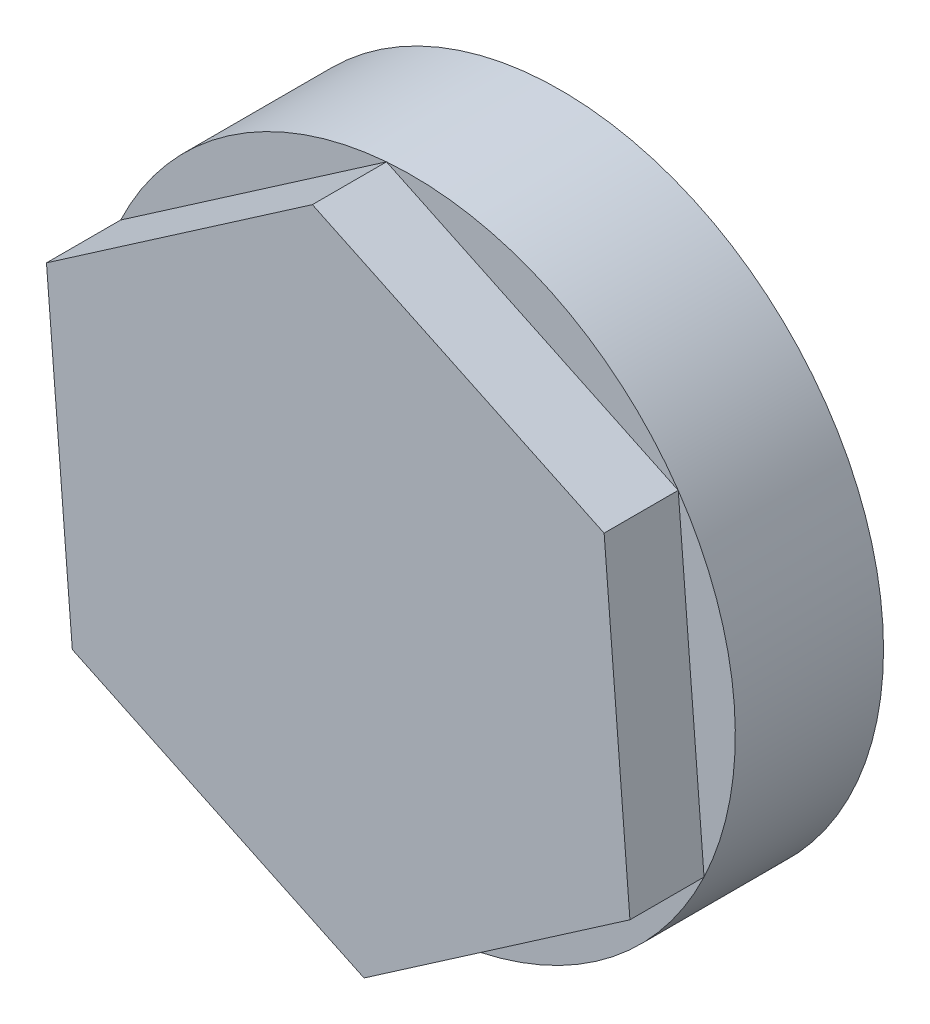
ISO-10303-21;
HEADER;
FILE_DESCRIPTION(('STEP AP214'),'2;1');
FILE_NAME('part.step','',(''),(''),'','','');
FILE_SCHEMA(('AUTOMOTIVE_DESIGN { 1 0 10303 214 1 1 1 1 }'));
ENDSEC;
DATA;
#1=APPLICATION_CONTEXT('core data for automotive mechanical design processes');
#2=APPLICATION_PROTOCOL_DEFINITION('international standard','automotive_design',2000,#1);
#3=PRODUCT_CONTEXT('',#1,'mechanical');
#4=PRODUCT('Part','Part','',(#3));
#5=PRODUCT_RELATED_PRODUCT_CATEGORY('part','',(#4));
#6=PRODUCT_DEFINITION_FORMATION('','',#4);
#7=PRODUCT_DEFINITION_CONTEXT('part definition',#1,'design');
#8=PRODUCT_DEFINITION('design','',#6,#7);
#9=PRODUCT_DEFINITION_SHAPE('','',#8);
#10=(LENGTH_UNIT() NAMED_UNIT(*) SI_UNIT(.MILLI.,.METRE.));
#11=(NAMED_UNIT(*) PLANE_ANGLE_UNIT() SI_UNIT($,.RADIAN.));
#12=(NAMED_UNIT(*) SI_UNIT($,.STERADIAN.) SOLID_ANGLE_UNIT());
#13=UNCERTAINTY_MEASURE_WITH_UNIT(LENGTH_MEASURE(1.E-05),#10,'distance_accuracy_value','');
#14=(GEOMETRIC_REPRESENTATION_CONTEXT(3) GLOBAL_UNCERTAINTY_ASSIGNED_CONTEXT((#13)) GLOBAL_UNIT_ASSIGNED_CONTEXT((#10,
#11,#12)) REPRESENTATION_CONTEXT('',''));
#15=CARTESIAN_POINT('',(0.,0.,0.));
#16=DIRECTION('',(0.,0.,1.));
#17=DIRECTION('',(1.,0.,0.));
#18=AXIS2_PLACEMENT_3D('',#15,#16,#17);
#19=CARTESIAN_POINT('',(39.8386023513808,59.6717164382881,10.));
#20=DIRECTION('',(0.,0.,1.));
#21=DIRECTION('',(1.,0.,0.));
#22=AXIS2_PLACEMENT_3D('',#19,#20,#21);
#23=PLANE('',#22);
#24=DIRECTION('',(0.823257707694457,0.567667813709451,0.));
#25=VECTOR('',#24,1.);
#26=CARTESIAN_POINT('',(41.5816515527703,37.9495804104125,10.));
#27=LINE('',#26,#25);
#28=CARTESIAN_POINT('',(41.5816515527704,37.9495804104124,10.));
#29=VERTEX_POINT('',#28);
#30=CARTESIAN_POINT('',(59.5220485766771,50.3201733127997,10.));
#31=VERTEX_POINT('',#30);
#32=EDGE_CURVE('E56',#29,#31,#27,.T.);
#33=ORIENTED_EDGE('',*,*,#32,.F.);
#34=CARTESIAN_POINT('',(39.8386023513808,59.6717164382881,10.));
#35=DIRECTION('',(0.,0.,1.));
#36=DIRECTION('',(1.,0.,0.));
#37=AXIS2_PLACEMENT_3D('',#34,#35,#36);
#38=CIRCLE('',#37,21.7919575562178);
#39=EDGE_CURVE('E112',#29,#31,#38,.T.);
#40=ORIENTED_EDGE('',*,*,#39,.T.);
#41=EDGE_LOOP('',(#33,#40));
#42=FACE_BOUND('',#41,.T.);
#43=ADVANCED_FACE('F34',(#42),#23,.T.);
#44=DIRECTION('',(0.903243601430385,-0.429128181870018,0.));
#45=VECTOR('',#44,1.);
#46=CARTESIAN_POINT('',(21.8982053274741,47.3011235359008,10.));
#47=LINE('',#46,#45);
#48=CARTESIAN_POINT('',(21.8982053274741,47.3011235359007,10.));
#49=VERTEX_POINT('',#48);
#50=EDGE_CURVE('E109',#49,#29,#47,.T.);
#51=ORIENTED_EDGE('',*,*,#50,.F.);
#52=EDGE_CURVE('E196',#49,#29,#38,.T.);
#53=ORIENTED_EDGE('',*,*,#52,.T.);
#54=EDGE_LOOP('',(#51,#53));
#55=FACE_BOUND('',#54,.T.);
#56=ADVANCED_FACE('F158',(#55),#23,.T.);
#57=DIRECTION('',(0.0799858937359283,-0.996795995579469,0.));
#58=VECTOR('',#57,1.);
#59=CARTESIAN_POINT('',(20.1551561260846,69.0232595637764,10.));
#60=LINE('',#59,#58);
#61=CARTESIAN_POINT('',(20.1551561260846,69.0232595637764,10.));
#62=VERTEX_POINT('',#61);
#63=EDGE_CURVE('E128',#62,#49,#60,.T.);
#64=ORIENTED_EDGE('',*,*,#63,.F.);
#65=EDGE_CURVE('E200',#62,#49,#38,.T.);
#66=ORIENTED_EDGE('',*,*,#65,.T.);
#67=EDGE_LOOP('',(#64,#66));
#68=FACE_BOUND('',#67,.T.);
#69=ADVANCED_FACE('F164',(#68),#23,.T.);
#70=DIRECTION('',(-0.823257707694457,-0.567667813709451,0.));
#71=VECTOR('',#70,1.);
#72=CARTESIAN_POINT('',(38.0955531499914,81.3938524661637,10.));
#73=LINE('',#72,#71);
#74=CARTESIAN_POINT('',(38.0955531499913,81.3938524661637,10.));
#75=VERTEX_POINT('',#74);
#76=EDGE_CURVE('E131',#75,#62,#73,.T.);
#77=ORIENTED_EDGE('',*,*,#76,.F.);
#78=EDGE_CURVE('E42',#75,#62,#38,.T.);
#79=ORIENTED_EDGE('',*,*,#78,.T.);
#80=EDGE_LOOP('',(#77,#79));
#81=FACE_BOUND('',#80,.T.);
#82=ADVANCED_FACE('F175',(#81),#23,.T.);
#83=DIRECTION('',(-0.903243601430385,0.429128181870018,0.));
#84=VECTOR('',#83,1.);
#85=CARTESIAN_POINT('',(57.7789993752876,72.0423093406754,10.));
#86=LINE('',#85,#84);
#87=CARTESIAN_POINT('',(57.7789993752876,72.0423093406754,10.));
#88=VERTEX_POINT('',#87);
#89=EDGE_CURVE('E134',#88,#75,#86,.T.);
#90=ORIENTED_EDGE('',*,*,#89,.F.);
#91=EDGE_CURVE('E12',#88,#75,#38,.T.);
#92=ORIENTED_EDGE('',*,*,#91,.T.);
#93=EDGE_LOOP('',(#90,#92));
#94=FACE_BOUND('',#93,.T.);
#95=ADVANCED_FACE('F168',(#94),#23,.T.);
#96=CARTESIAN_POINT('',(39.8386023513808,59.6717164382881,10.));
#97=DIRECTION('',(0.,0.,-1.));
#98=DIRECTION('',(-1.,0.,0.));
#99=AXIS2_PLACEMENT_3D('',#96,#97,#98);
#100=CYLINDRICAL_SURFACE('',#99,21.7919575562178);
#101=ORIENTED_EDGE('',*,*,#91,.F.);
#102=EDGE_CURVE('E43',#31,#88,#38,.T.);
#103=ORIENTED_EDGE('',*,*,#102,.F.);
#104=ORIENTED_EDGE('',*,*,#39,.F.);
#105=ORIENTED_EDGE('',*,*,#52,.F.);
#106=ORIENTED_EDGE('',*,*,#65,.F.);
#107=ORIENTED_EDGE('',*,*,#78,.F.);
#108=EDGE_LOOP('',(#101,#103,#104,#105,#106,#107));
#109=FACE_BOUND('',#108,.T.);
#110=CARTESIAN_POINT('',(39.8386023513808,59.6717164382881,0.));
#111=DIRECTION('',(0.,0.,1.));
#112=DIRECTION('',(1.,0.,0.));
#113=AXIS2_PLACEMENT_3D('',#110,#111,#112);
#114=CIRCLE('',#113,21.7919575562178);
#115=CARTESIAN_POINT('',(61.6305599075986,59.6717164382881,0.));
#116=VERTEX_POINT('',#115);
#117=EDGE_CURVE('E139',#116,#116,#114,.T.);
#118=ORIENTED_EDGE('',*,*,#117,.T.);
#119=EDGE_LOOP('',(#118));
#120=FACE_BOUND('',#119,.T.);
#121=ADVANCED_FACE('F149',(#109,#120),#100,.T.);
#122=DIRECTION('',(-0.0799858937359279,0.996795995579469,0.));
#123=VECTOR('',#122,1.);
#124=CARTESIAN_POINT('',(59.5220485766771,50.3201733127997,10.));
#125=LINE('',#124,#123);
#126=EDGE_CURVE('E49',#31,#88,#125,.T.);
#127=ORIENTED_EDGE('',*,*,#126,.F.);
#128=ORIENTED_EDGE('',*,*,#102,.T.);
#129=EDGE_LOOP('',(#127,#128));
#130=FACE_BOUND('',#129,.T.);
#131=ADVANCED_FACE('F160',(#130),#23,.T.);
#132=CARTESIAN_POINT('',(41.5816515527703,37.9495804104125,15.));
#133=DIRECTION('',(-0.567667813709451,0.823257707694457,0.));
#134=DIRECTION('',(-0.823257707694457,-0.567667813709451,0.));
#135=AXIS2_PLACEMENT_3D('',#132,#133,#134);
#136=PLANE('',#135);
#137=ORIENTED_EDGE('',*,*,#32,.T.);
#138=DIRECTION('',(0.,0.,-1.));
#139=VECTOR('',#138,1.);
#140=CARTESIAN_POINT('',(59.5220485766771,50.3201733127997,15.));
#141=LINE('',#140,#139);
#142=CARTESIAN_POINT('',(59.5220485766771,50.3201733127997,15.));
#143=VERTEX_POINT('',#142);
#144=EDGE_CURVE('E94',#143,#31,#141,.T.);
#145=ORIENTED_EDGE('',*,*,#144,.F.);
#146=DIRECTION('',(0.823257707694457,0.567667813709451,0.));
#147=VECTOR('',#146,1.);
#148=CARTESIAN_POINT('',(41.5816515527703,37.9495804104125,15.));
#149=LINE('',#148,#147);
#150=CARTESIAN_POINT('',(41.5816515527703,37.9495804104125,15.));
#151=VERTEX_POINT('',#150);
#152=EDGE_CURVE('E100',#151,#143,#149,.T.);
#153=ORIENTED_EDGE('',*,*,#152,.F.);
#154=DIRECTION('',(0.,0.,-1.));
#155=VECTOR('',#154,1.);
#156=CARTESIAN_POINT('',(41.5816515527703,37.9495804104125,15.));
#157=LINE('',#156,#155);
#158=EDGE_CURVE('E124',#151,#29,#157,.T.);
#159=ORIENTED_EDGE('',*,*,#158,.T.);
#160=EDGE_LOOP('',(#137,#145,#153,#159));
#161=FACE_BOUND('',#160,.T.);
#162=ADVANCED_FACE('F111',(#161),#136,.F.);
#163=CARTESIAN_POINT('',(59.5220485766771,50.3201733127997,15.));
#164=DIRECTION('',(-0.996795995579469,-0.0799858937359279,0.));
#165=DIRECTION('',(0.0799858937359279,-0.996795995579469,0.));
#166=AXIS2_PLACEMENT_3D('',#163,#164,#165);
#167=PLANE('',#166);
#168=ORIENTED_EDGE('',*,*,#126,.T.);
#169=DIRECTION('',(0.,0.,-1.));
#170=VECTOR('',#169,1.);
#171=CARTESIAN_POINT('',(57.7789993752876,72.0423093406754,15.));
#172=LINE('',#171,#170);
#173=CARTESIAN_POINT('',(57.7789993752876,72.0423093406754,15.));
#174=VERTEX_POINT('',#173);
#175=EDGE_CURVE('E96',#174,#88,#172,.T.);
#176=ORIENTED_EDGE('',*,*,#175,.F.);
#177=DIRECTION('',(-0.0799858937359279,0.996795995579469,0.));
#178=VECTOR('',#177,1.);
#179=CARTESIAN_POINT('',(59.5220485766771,50.3201733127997,15.));
#180=LINE('',#179,#178);
#181=EDGE_CURVE('E90',#143,#174,#180,.T.);
#182=ORIENTED_EDGE('',*,*,#181,.F.);
#183=ORIENTED_EDGE('',*,*,#144,.T.);
#184=EDGE_LOOP('',(#168,#176,#182,#183));
#185=FACE_BOUND('',#184,.T.);
#186=ADVANCED_FACE('F92',(#185),#167,.F.);
#187=CARTESIAN_POINT('',(57.7789993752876,72.0423093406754,15.));
#188=DIRECTION('',(-0.429128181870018,-0.903243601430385,0.));
#189=DIRECTION('',(0.903243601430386,-0.429128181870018,0.));
#190=AXIS2_PLACEMENT_3D('',#187,#188,#189);
#191=PLANE('',#190);
#192=ORIENTED_EDGE('',*,*,#89,.T.);
#193=DIRECTION('',(0.,0.,-1.));
#194=VECTOR('',#193,1.);
#195=CARTESIAN_POINT('',(38.0955531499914,81.3938524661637,15.));
#196=LINE('',#195,#194);
#197=CARTESIAN_POINT('',(38.0955531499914,81.3938524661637,15.));
#198=VERTEX_POINT('',#197);
#199=EDGE_CURVE('E113',#198,#75,#196,.T.);
#200=ORIENTED_EDGE('',*,*,#199,.F.);
#201=DIRECTION('',(-0.903243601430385,0.429128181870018,0.));
#202=VECTOR('',#201,1.);
#203=CARTESIAN_POINT('',(57.7789993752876,72.0423093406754,15.));
#204=LINE('',#203,#202);
#205=EDGE_CURVE('E99',#174,#198,#204,.T.);
#206=ORIENTED_EDGE('',*,*,#205,.F.);
#207=ORIENTED_EDGE('',*,*,#175,.T.);
#208=EDGE_LOOP('',(#192,#200,#206,#207));
#209=FACE_BOUND('',#208,.T.);
#210=ADVANCED_FACE('F184',(#209),#191,.F.);
#211=CARTESIAN_POINT('',(38.0955531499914,81.3938524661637,15.));
#212=DIRECTION('',(0.567667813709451,-0.823257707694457,0.));
#213=DIRECTION('',(0.823257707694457,0.567667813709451,0.));
#214=AXIS2_PLACEMENT_3D('',#211,#212,#213);
#215=PLANE('',#214);
#216=ORIENTED_EDGE('',*,*,#76,.T.);
#217=DIRECTION('',(0.,0.,-1.));
#218=VECTOR('',#217,1.);
#219=CARTESIAN_POINT('',(20.1551561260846,69.0232595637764,15.));
#220=LINE('',#219,#218);
#221=CARTESIAN_POINT('',(20.1551561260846,69.0232595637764,15.));
#222=VERTEX_POINT('',#221);
#223=EDGE_CURVE('E118',#222,#62,#220,.T.);
#224=ORIENTED_EDGE('',*,*,#223,.F.);
#225=DIRECTION('',(-0.823257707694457,-0.567667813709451,0.));
#226=VECTOR('',#225,1.);
#227=CARTESIAN_POINT('',(38.0955531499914,81.3938524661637,15.));
#228=LINE('',#227,#226);
#229=EDGE_CURVE('E143',#198,#222,#228,.T.);
#230=ORIENTED_EDGE('',*,*,#229,.F.);
#231=ORIENTED_EDGE('',*,*,#199,.T.);
#232=EDGE_LOOP('',(#216,#224,#230,#231));
#233=FACE_BOUND('',#232,.T.);
#234=ADVANCED_FACE('F190',(#233),#215,.F.);
#235=CARTESIAN_POINT('',(20.1551561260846,69.0232595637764,15.));
#236=DIRECTION('',(0.996795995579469,0.0799858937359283,0.));
#237=DIRECTION('',(-0.0799858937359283,0.996795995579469,0.));
#238=AXIS2_PLACEMENT_3D('',#235,#236,#237);
#239=PLANE('',#238);
#240=ORIENTED_EDGE('',*,*,#63,.T.);
#241=DIRECTION('',(0.,0.,-1.));
#242=VECTOR('',#241,1.);
#243=CARTESIAN_POINT('',(21.8982053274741,47.3011235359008,15.));
#244=LINE('',#243,#242);
#245=CARTESIAN_POINT('',(21.8982053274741,47.3011235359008,15.));
#246=VERTEX_POINT('',#245);
#247=EDGE_CURVE('E121',#246,#49,#244,.T.);
#248=ORIENTED_EDGE('',*,*,#247,.F.);
#249=DIRECTION('',(0.0799858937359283,-0.996795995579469,0.));
#250=VECTOR('',#249,1.);
#251=CARTESIAN_POINT('',(20.1551561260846,69.0232595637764,15.));
#252=LINE('',#251,#250);
#253=EDGE_CURVE('E141',#222,#246,#252,.T.);
#254=ORIENTED_EDGE('',*,*,#253,.F.);
#255=ORIENTED_EDGE('',*,*,#223,.T.);
#256=EDGE_LOOP('',(#240,#248,#254,#255));
#257=FACE_BOUND('',#256,.T.);
#258=ADVANCED_FACE('F192',(#257),#239,.F.);
#259=CARTESIAN_POINT('',(21.8982053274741,47.3011235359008,15.));
#260=DIRECTION('',(0.429128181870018,0.903243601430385,0.));
#261=DIRECTION('',(-0.903243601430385,0.429128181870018,0.));
#262=AXIS2_PLACEMENT_3D('',#259,#260,#261);
#263=PLANE('',#262);
#264=ORIENTED_EDGE('',*,*,#50,.T.);
#265=ORIENTED_EDGE('',*,*,#158,.F.);
#266=DIRECTION('',(0.903243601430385,-0.429128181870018,0.));
#267=VECTOR('',#266,1.);
#268=CARTESIAN_POINT('',(21.8982053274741,47.3011235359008,15.));
#269=LINE('',#268,#267);
#270=EDGE_CURVE('E105',#246,#151,#269,.T.);
#271=ORIENTED_EDGE('',*,*,#270,.F.);
#272=ORIENTED_EDGE('',*,*,#247,.T.);
#273=EDGE_LOOP('',(#264,#265,#271,#272));
#274=FACE_BOUND('',#273,.T.);
#275=ADVANCED_FACE('F155',(#274),#263,.F.);
#276=CARTESIAN_POINT('',(41.5816515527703,37.9495804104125,15.));
#277=DIRECTION('',(0.,0.,-1.));
#278=DIRECTION('',(-1.,0.,0.));
#279=AXIS2_PLACEMENT_3D('',#276,#277,#278);
#280=PLANE('',#279);
#281=ORIENTED_EDGE('',*,*,#152,.T.);
#282=ORIENTED_EDGE('',*,*,#181,.T.);
#283=ORIENTED_EDGE('',*,*,#205,.T.);
#284=ORIENTED_EDGE('',*,*,#229,.T.);
#285=ORIENTED_EDGE('',*,*,#253,.T.);
#286=ORIENTED_EDGE('',*,*,#270,.T.);
#287=EDGE_LOOP('',(#281,#282,#283,#284,#285,#286));
#288=FACE_BOUND('',#287,.T.);
#289=ADVANCED_FACE('F103',(#288),#280,.F.);
#290=CARTESIAN_POINT('',(0.,99.1284431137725,0.));
#291=DIRECTION('',(0.,0.,-1.));
#292=DIRECTION('',(-1.,0.,0.));
#293=AXIS2_PLACEMENT_3D('',#290,#291,#292);
#294=PLANE('',#293);
#295=ORIENTED_EDGE('',*,*,#117,.F.);
#296=EDGE_LOOP('',(#295));
#297=FACE_BOUND('',#296,.T.);
#298=ADVANCED_FACE('F36',(#297),#294,.T.);
#299=CLOSED_SHELL('',(#43,#56,#69,#82,#95,#121,#131,#162,#186,#210,#234,#258,#275,#289,#298));
#300=MANIFOLD_SOLID_BREP('B2',#299);
#301=ADVANCED_BREP_SHAPE_REPRESENTATION('',(#18,#300),#14);
#302=SHAPE_DEFINITION_REPRESENTATION(#9,#301);
ENDSEC;
END-ISO-10303-21;
